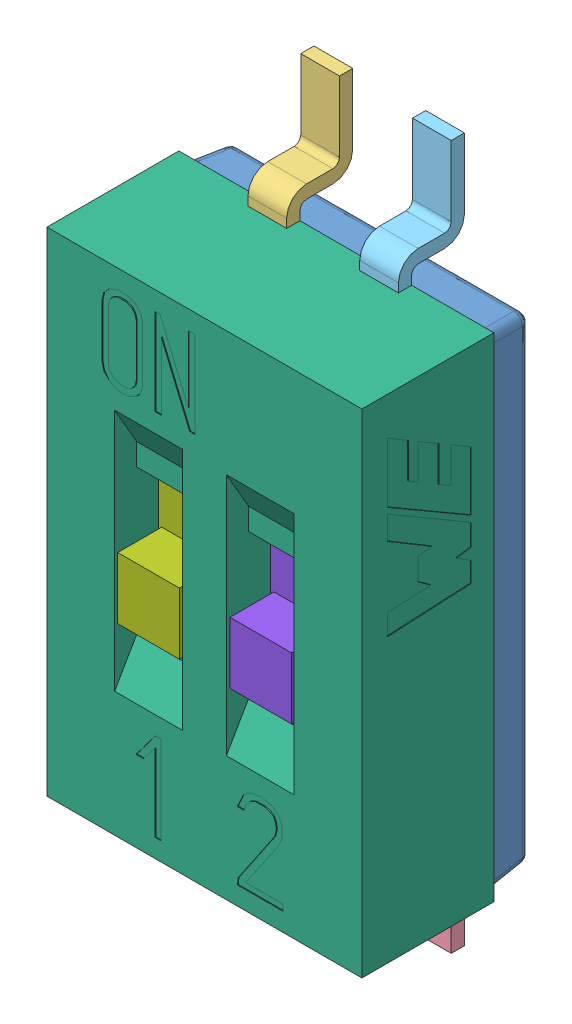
SolidWorks assembly 43609_Temp.SLDASM, configuration Default (file format 4100). Lengths in mm.
Overall size (3.58 8 2.15).
8 component instances, 8 part files, 0 mates.
Components (placement in the parent):
- 43609_01-1: 43609_01.SLDPRT [Default] at origin size (3.48 5.5 0.68)
- 43609_02-1: 43609_02.SLDPRT [Default] at origin size (1 3.75 0.75)
- 43609_03-1: 43609_03.SLDPRT [Default] at origin size (1 2.85 0.75)
- 43609_04-1: 43609_04.SLDPRT [Default] at origin size (1 3.75 0.75)
- 43609_05-1: 43609_05.SLDPRT [Default] at origin size (1 2.85 0.75)
- 43609_06-1: 43609_06.SLDPRT [Default] at origin size (3.58 5.6 1.55)
- 43609_07-1: 43609_07.SLDPRT [Default] at origin size (1 2.6 0.95)
- 43609_08-1: 43609_08.SLDPRT [Default] at origin size (1 2.6 0.95)
